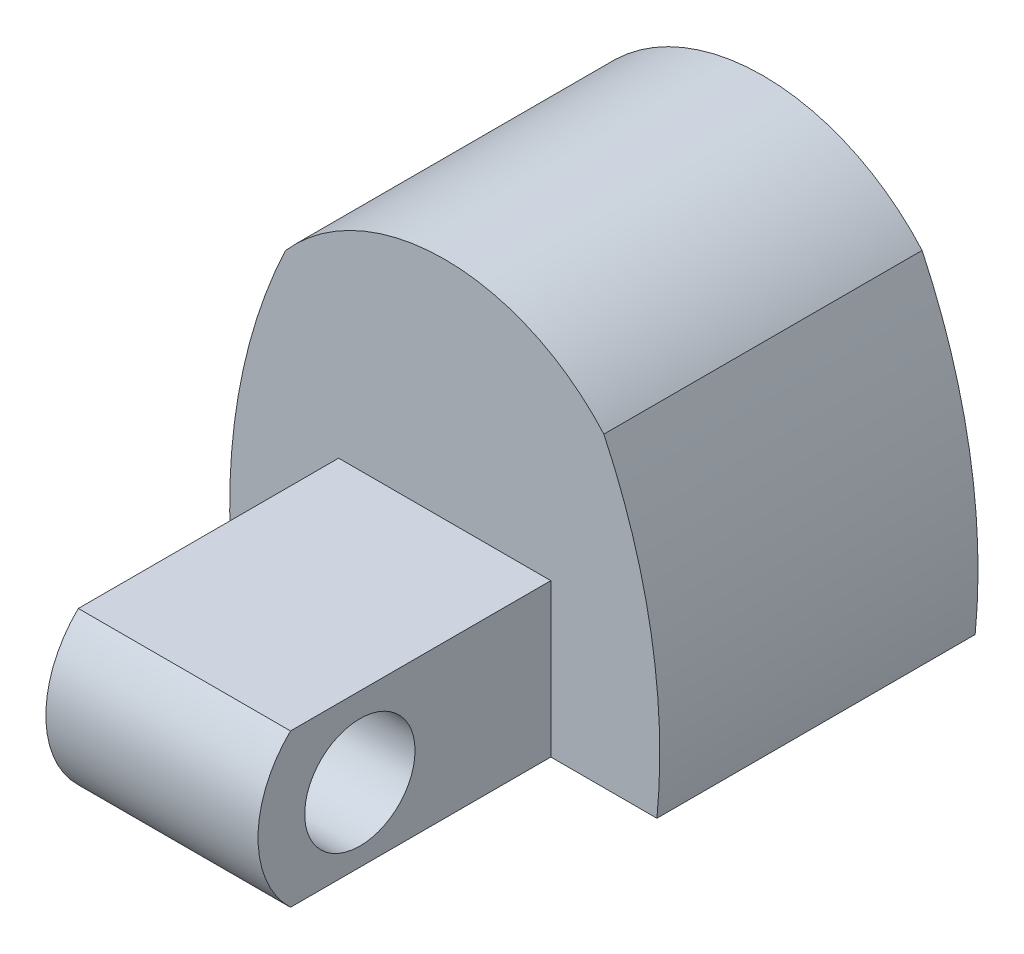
from build123d import *

# Parameters (mm, degrees)
SALIENTE_EXTRUIR1_DEPTH      = 15
CORTAR_EXTRUIR1_DEPTH        = 12
CROQUIS5_R                   = 2
SALIENTE_EXTRUIR3_DEPTH      = 18
SALIENTE_EXTRUIR4_DEPTH      = 5
SALIENTE_EXTRUIR4_DEPTH_BACK = 5
CROQUIS2_R                   = 2.6


with BuildPart() as part:
    # Croquis1 → Saliente-Extruir1 (new body)
    with BuildSketch(Plane.XY):
        with BuildLine():
            ThreePointArc((-7.5, 14.43), (-9.733436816, 7.385380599), (-10, 0))
            Line((-10, 0), (10, 0))
            ThreePointArc((10, 0), (9.733436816, 7.385380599), (7.5, 14.43))
            ThreePointArc((7.5, 14.43), (0, 17.815621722), (-7.5, 14.43))
        make_face()
    extrude(amount=SALIENTE_EXTRUIR1_DEPTH)

    # Croquis4 → Cortar-Extruir1 (cut)
    with BuildSketch(Plane(origin=(0, 0, 0), x_dir=(-1, 0, 0), z_dir=(0, 0, -1))):
        with BuildLine():
            Line((-8.45, 0), (8.45, 0))
            ThreePointArc((8.45, 0), (7.623416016, 9.60268486), (0, 15.5))
            ThreePointArc((0, 15.5), (-7.623416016, 9.60268486), (-8.45, 0))
        make_face()
    extrude(amount=-CORTAR_EXTRUIR1_DEPTH, mode=Mode.SUBTRACT)

    # Croquis5 → Saliente-Extruir3 (add)
    with BuildSketch(Plane(origin=(9, 0, 0), x_dir=(0, 0, -1), z_dir=(1, 0, 0))):
        with Locations(Location((-2.5, 3.465621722, 0), (0, 0, 328.257405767))):
            Circle(CROQUIS5_R)
    extrude(amount=-SALIENTE_EXTRUIR3_DEPTH)

    # Croquis2 → Saliente-Extruir4 (add, two sides: drawn at the far end of the back side and taken through both)
    with BuildSketch(Plane(origin=(0, 0, 0), x_dir=(0, 0, -1), z_dir=(1, 0, 0)).offset(-SALIENTE_EXTRUIR4_DEPTH_BACK)):
        with BuildLine():
            Line((-15, 0), (-27.269870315, 0))
            ThreePointArc((-27.269870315, 0), (-28.8, 3.6), (-27.269870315, 7.2))
            Line((-27.269870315, 7.2), (-15, 7.2))
            Line((-15, 7.2), (-15, 0))
        make_face()
        with Locations((-24, 3.465621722)):
            Circle(CROQUIS2_R, mode=Mode.SUBTRACT)
    extrude(amount=SALIENTE_EXTRUIR4_DEPTH + SALIENTE_EXTRUIR4_DEPTH_BACK)


solid = part.part
